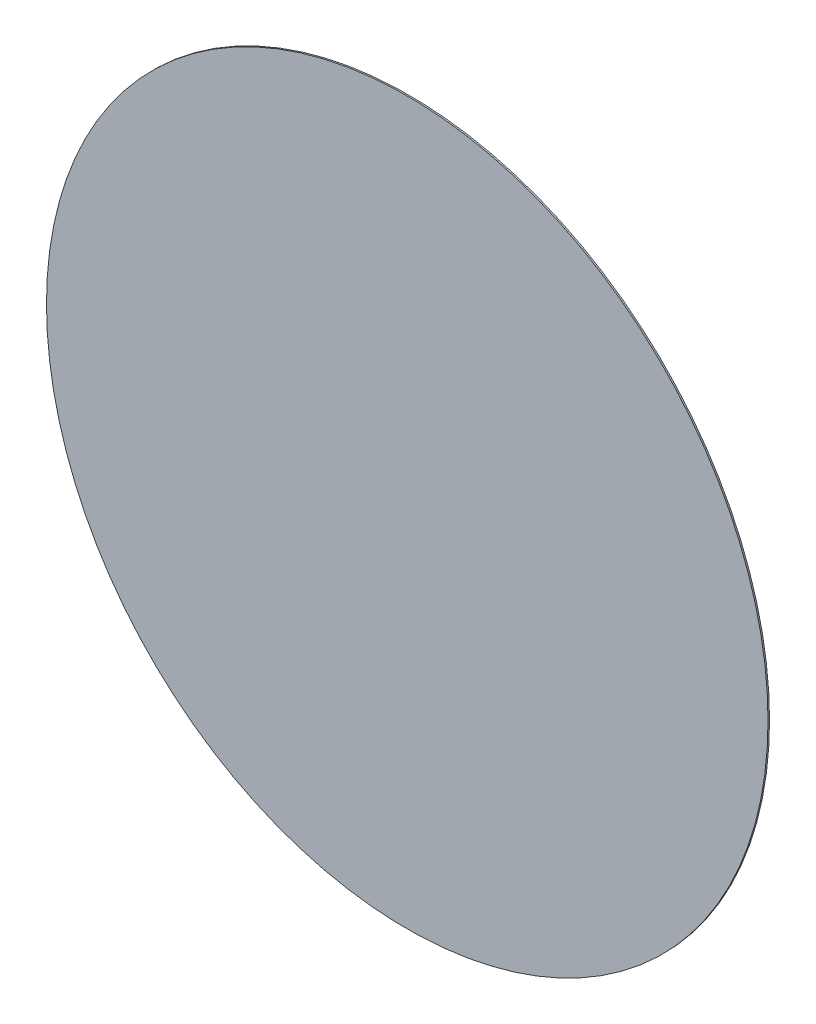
ISO-10303-21;
HEADER;
FILE_DESCRIPTION(('STEP AP214'),'2;1');
FILE_NAME('part.step','',(''),(''),'','','');
FILE_SCHEMA(('AUTOMOTIVE_DESIGN { 1 0 10303 214 1 1 1 1 }'));
ENDSEC;
DATA;
#1=APPLICATION_CONTEXT('core data for automotive mechanical design processes');
#2=APPLICATION_PROTOCOL_DEFINITION('international standard','automotive_design',2000,#1);
#3=PRODUCT_CONTEXT('',#1,'mechanical');
#4=PRODUCT('Part','Part','',(#3));
#5=PRODUCT_RELATED_PRODUCT_CATEGORY('part','',(#4));
#6=PRODUCT_DEFINITION_FORMATION('','',#4);
#7=PRODUCT_DEFINITION_CONTEXT('part definition',#1,'design');
#8=PRODUCT_DEFINITION('design','',#6,#7);
#9=PRODUCT_DEFINITION_SHAPE('','',#8);
#10=(LENGTH_UNIT() NAMED_UNIT(*) SI_UNIT(.MILLI.,.METRE.));
#11=(NAMED_UNIT(*) PLANE_ANGLE_UNIT() SI_UNIT($,.RADIAN.));
#12=(NAMED_UNIT(*) SI_UNIT($,.STERADIAN.) SOLID_ANGLE_UNIT());
#13=UNCERTAINTY_MEASURE_WITH_UNIT(LENGTH_MEASURE(1.E-05),#10,'distance_accuracy_value','');
#14=(GEOMETRIC_REPRESENTATION_CONTEXT(3) GLOBAL_UNCERTAINTY_ASSIGNED_CONTEXT((#13)) GLOBAL_UNIT_ASSIGNED_CONTEXT((#10,
#11,#12)) REPRESENTATION_CONTEXT('',''));
#15=CARTESIAN_POINT('',(0.,0.,0.));
#16=DIRECTION('',(0.,0.,1.));
#17=DIRECTION('',(1.,0.,0.));
#18=AXIS2_PLACEMENT_3D('',#15,#16,#17);
#19=CARTESIAN_POINT('',(0.,0.,0.));
#20=DIRECTION('',(0.,0.,-1.));
#21=DIRECTION('',(-1.,0.,0.));
#22=AXIS2_PLACEMENT_3D('',#19,#20,#21);
#23=PLANE('',#22);
#24=CARTESIAN_POINT('',(0.,0.,0.));
#25=DIRECTION('',(0.,0.,1.));
#26=DIRECTION('',(1.,0.,0.));
#27=AXIS2_PLACEMENT_3D('',#24,#25,#26);
#28=CIRCLE('',#27,24.);
#29=CARTESIAN_POINT('',(24.,0.,0.));
#30=VERTEX_POINT('',#29);
#31=EDGE_CURVE('E18',#30,#30,#28,.T.);
#32=ORIENTED_EDGE('',*,*,#31,.F.);
#33=EDGE_LOOP('',(#32));
#34=FACE_BOUND('',#33,.T.);
#35=ADVANCED_FACE('F15',(#34),#23,.T.);
#36=CARTESIAN_POINT('',(0.,0.,0.));
#37=DIRECTION('',(0.,0.,1.));
#38=DIRECTION('',(1.,0.,0.));
#39=AXIS2_PLACEMENT_3D('',#36,#37,#38);
#40=CYLINDRICAL_SURFACE('',#39,24.);
#41=ORIENTED_EDGE('',*,*,#31,.T.);
#42=EDGE_LOOP('',(#41));
#43=FACE_BOUND('',#42,.T.);
#44=CARTESIAN_POINT('',(0.,0.,0.1));
#45=DIRECTION('',(0.,0.,1.));
#46=DIRECTION('',(1.,0.,0.));
#47=AXIS2_PLACEMENT_3D('',#44,#45,#46);
#48=CIRCLE('',#47,24.);
#49=CARTESIAN_POINT('',(24.,0.,0.1));
#50=VERTEX_POINT('',#49);
#51=EDGE_CURVE('E10',#50,#50,#48,.F.);
#52=ORIENTED_EDGE('',*,*,#51,.T.);
#53=EDGE_LOOP('',(#52));
#54=FACE_BOUND('',#53,.T.);
#55=ADVANCED_FACE('F27',(#43,#54),#40,.T.);
#56=CARTESIAN_POINT('',(0.,0.,0.1));
#57=DIRECTION('',(0.,0.,-1.));
#58=DIRECTION('',(-1.,0.,0.));
#59=AXIS2_PLACEMENT_3D('',#56,#57,#58);
#60=PLANE('',#59);
#61=ORIENTED_EDGE('',*,*,#51,.F.);
#62=EDGE_LOOP('',(#61));
#63=FACE_BOUND('',#62,.T.);
#64=ADVANCED_FACE('F34',(#63),#60,.F.);
#65=CLOSED_SHELL('',(#35,#55,#64));
#66=MANIFOLD_SOLID_BREP('B1',#65);
#67=ADVANCED_BREP_SHAPE_REPRESENTATION('',(#18,#66),#14);
#68=SHAPE_DEFINITION_REPRESENTATION(#9,#67);
ENDSEC;
END-ISO-10303-21;
